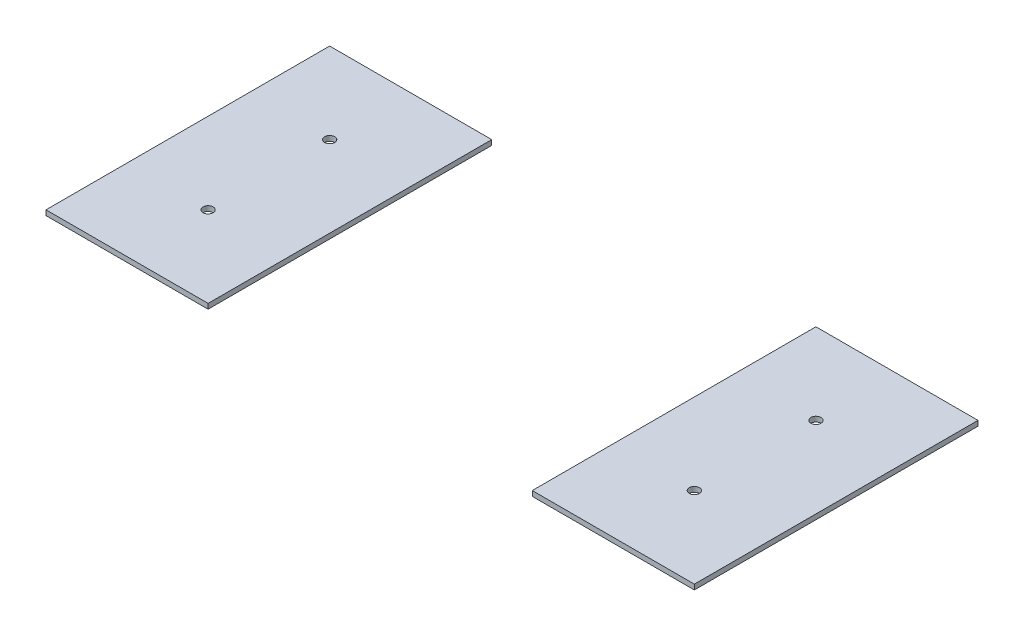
ISO-10303-21;
HEADER;
FILE_DESCRIPTION(('STEP AP214'),'2;1');
FILE_NAME('part.step','',(''),(''),'','','');
FILE_SCHEMA(('AUTOMOTIVE_DESIGN { 1 0 10303 214 1 1 1 1 }'));
ENDSEC;
DATA;
#1=APPLICATION_CONTEXT('core data for automotive mechanical design processes');
#2=APPLICATION_PROTOCOL_DEFINITION('international standard','automotive_design',2000,#1);
#3=PRODUCT_CONTEXT('',#1,'mechanical');
#4=PRODUCT('Part','Part','',(#3));
#5=PRODUCT_RELATED_PRODUCT_CATEGORY('part','',(#4));
#6=PRODUCT_DEFINITION_FORMATION('','',#4);
#7=PRODUCT_DEFINITION_CONTEXT('part definition',#1,'design');
#8=PRODUCT_DEFINITION('design','',#6,#7);
#9=PRODUCT_DEFINITION_SHAPE('','',#8);
#10=(LENGTH_UNIT() NAMED_UNIT(*) SI_UNIT(.MILLI.,.METRE.));
#11=(NAMED_UNIT(*) PLANE_ANGLE_UNIT() SI_UNIT($,.RADIAN.));
#12=(NAMED_UNIT(*) SI_UNIT($,.STERADIAN.) SOLID_ANGLE_UNIT());
#13=UNCERTAINTY_MEASURE_WITH_UNIT(LENGTH_MEASURE(1.E-05),#10,'distance_accuracy_value','');
#14=(GEOMETRIC_REPRESENTATION_CONTEXT(3) GLOBAL_UNCERTAINTY_ASSIGNED_CONTEXT((#13)) GLOBAL_UNIT_ASSIGNED_CONTEXT((#10,
#11,#12)) REPRESENTATION_CONTEXT('',''));
#15=CARTESIAN_POINT('',(0.,0.,0.));
#16=DIRECTION('',(0.,0.,1.));
#17=DIRECTION('',(1.,0.,0.));
#18=AXIS2_PLACEMENT_3D('',#15,#16,#17);
#19=CARTESIAN_POINT('',(-203.2,0.,177.8));
#20=DIRECTION('',(0.,1.,0.));
#21=DIRECTION('',(-1.,0.,0.));
#22=AXIS2_PLACEMENT_3D('',#19,#20,#21);
#23=PLANE('',#22);
#24=CARTESIAN_POINT('',(152.4,0.,-38.1));
#25=DIRECTION('',(0.,1.,0.));
#26=DIRECTION('',(1.,0.,0.));
#27=AXIS2_PLACEMENT_3D('',#24,#25,#26);
#28=CIRCLE('',#27,3.175);
#29=CARTESIAN_POINT('',(155.575,0.,-38.1));
#30=VERTEX_POINT('',#29);
#31=EDGE_CURVE('E113',#30,#30,#28,.T.);
#32=ORIENTED_EDGE('',*,*,#31,.T.);
#33=EDGE_LOOP('',(#32));
#34=FACE_BOUND('',#33,.T.);
#35=CARTESIAN_POINT('',(152.4,0.,38.1));
#36=DIRECTION('',(0.,1.,0.));
#37=DIRECTION('',(1.,0.,0.));
#38=AXIS2_PLACEMENT_3D('',#35,#36,#37);
#39=CIRCLE('',#38,3.17499999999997);
#40=CARTESIAN_POINT('',(155.575,0.,38.1));
#41=VERTEX_POINT('',#40);
#42=EDGE_CURVE('E104',#41,#41,#39,.T.);
#43=ORIENTED_EDGE('',*,*,#42,.T.);
#44=EDGE_LOOP('',(#43));
#45=FACE_BOUND('',#44,.T.);
#46=DIRECTION('',(1.,0.,0.));
#47=VECTOR('',#46,1.);
#48=CARTESIAN_POINT('',(-203.2,0.,88.9));
#49=LINE('',#48,#47);
#50=CARTESIAN_POINT('',(101.6,0.,88.9));
#51=VERTEX_POINT('',#50);
#52=CARTESIAN_POINT('',(203.2,0.,88.9));
#53=VERTEX_POINT('',#52);
#54=EDGE_CURVE('E81',#51,#53,#49,.T.);
#55=ORIENTED_EDGE('',*,*,#54,.F.);
#56=DIRECTION('',(0.,0.,-1.));
#57=VECTOR('',#56,1.);
#58=CARTESIAN_POINT('',(101.6,0.,88.9));
#59=LINE('',#58,#57);
#60=CARTESIAN_POINT('',(101.6,0.,-88.8999999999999));
#61=VERTEX_POINT('',#60);
#62=EDGE_CURVE('E98',#51,#61,#59,.T.);
#63=ORIENTED_EDGE('',*,*,#62,.T.);
#64=DIRECTION('',(-1.,0.,0.));
#65=VECTOR('',#64,1.);
#66=CARTESIAN_POINT('',(-203.2,0.,-88.9));
#67=LINE('',#66,#65);
#68=CARTESIAN_POINT('',(203.2,0.,-88.9));
#69=VERTEX_POINT('',#68);
#70=EDGE_CURVE('E97',#69,#61,#67,.T.);
#71=ORIENTED_EDGE('',*,*,#70,.F.);
#72=DIRECTION('',(0.,0.,-1.));
#73=VECTOR('',#72,1.);
#74=CARTESIAN_POINT('',(203.2,0.,177.8));
#75=LINE('',#74,#73);
#76=EDGE_CURVE('E85',#53,#69,#75,.T.);
#77=ORIENTED_EDGE('',*,*,#76,.F.);
#78=EDGE_LOOP('',(#55,#63,#71,#77));
#79=FACE_BOUND('',#78,.T.);
#80=ADVANCED_FACE('F42',(#34,#45,#79),#23,.F.);
#81=CARTESIAN_POINT('',(203.2,3.17500000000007,177.8));
#82=DIRECTION('',(0.,-1.,0.));
#83=DIRECTION('',(1.,0.,0.));
#84=AXIS2_PLACEMENT_3D('',#81,#82,#83);
#85=PLANE('',#84);
#86=CARTESIAN_POINT('',(152.4,3.17500000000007,-38.1));
#87=DIRECTION('',(0.,1.,0.));
#88=DIRECTION('',(1.,0.,0.));
#89=AXIS2_PLACEMENT_3D('',#86,#87,#88);
#90=CIRCLE('',#89,3.175);
#91=CARTESIAN_POINT('',(155.575,3.17500000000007,-38.1));
#92=VERTEX_POINT('',#91);
#93=EDGE_CURVE('E108',#92,#92,#90,.T.);
#94=ORIENTED_EDGE('',*,*,#93,.F.);
#95=EDGE_LOOP('',(#94));
#96=FACE_BOUND('',#95,.T.);
#97=CARTESIAN_POINT('',(152.4,3.17500000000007,38.1));
#98=DIRECTION('',(0.,1.,0.));
#99=DIRECTION('',(1.,0.,0.));
#100=AXIS2_PLACEMENT_3D('',#97,#98,#99);
#101=CIRCLE('',#100,3.17499999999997);
#102=CARTESIAN_POINT('',(155.575,3.17500000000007,38.1));
#103=VERTEX_POINT('',#102);
#104=EDGE_CURVE('E112',#103,#103,#101,.T.);
#105=ORIENTED_EDGE('',*,*,#104,.F.);
#106=EDGE_LOOP('',(#105));
#107=FACE_BOUND('',#106,.T.);
#108=DIRECTION('',(1.,0.,0.));
#109=VECTOR('',#108,1.);
#110=CARTESIAN_POINT('',(-203.2,3.175,-88.9));
#111=LINE('',#110,#109);
#112=CARTESIAN_POINT('',(101.6,3.17500000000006,-88.8999999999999));
#113=VERTEX_POINT('',#112);
#114=CARTESIAN_POINT('',(203.2,3.17500000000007,-88.9));
#115=VERTEX_POINT('',#114);
#116=EDGE_CURVE('E93',#113,#115,#111,.T.);
#117=ORIENTED_EDGE('',*,*,#116,.F.);
#118=DIRECTION('',(0.,0.,-1.));
#119=VECTOR('',#118,1.);
#120=CARTESIAN_POINT('',(101.6,3.17500000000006,88.9));
#121=LINE('',#120,#119);
#122=CARTESIAN_POINT('',(101.6,3.17500000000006,88.9));
#123=VERTEX_POINT('',#122);
#124=EDGE_CURVE('E51',#123,#113,#121,.T.);
#125=ORIENTED_EDGE('',*,*,#124,.F.);
#126=DIRECTION('',(-1.,0.,0.));
#127=VECTOR('',#126,1.);
#128=CARTESIAN_POINT('',(-203.2,3.175,88.9));
#129=LINE('',#128,#127);
#130=CARTESIAN_POINT('',(203.2,3.17500000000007,88.9));
#131=VERTEX_POINT('',#130);
#132=EDGE_CURVE('E45',#131,#123,#129,.T.);
#133=ORIENTED_EDGE('',*,*,#132,.F.);
#134=DIRECTION('',(0.,0.,-1.));
#135=VECTOR('',#134,1.);
#136=CARTESIAN_POINT('',(203.2,3.17500000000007,177.8));
#137=LINE('',#136,#135);
#138=EDGE_CURVE('E91',#131,#115,#137,.T.);
#139=ORIENTED_EDGE('',*,*,#138,.T.);
#140=EDGE_LOOP('',(#117,#125,#133,#139));
#141=FACE_BOUND('',#140,.T.);
#142=ADVANCED_FACE('F90',(#96,#107,#141),#85,.F.);
#143=CARTESIAN_POINT('',(-203.2,-0.00100000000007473,-88.9));
#144=DIRECTION('',(0.,0.,1.));
#145=DIRECTION('',(1.,0.,0.));
#146=AXIS2_PLACEMENT_3D('',#143,#144,#145);
#147=PLANE('',#146);
#148=ORIENTED_EDGE('',*,*,#70,.T.);
#149=DIRECTION('',(0.,1.,0.));
#150=VECTOR('',#149,1.);
#151=CARTESIAN_POINT('',(101.6,0.,-88.8999999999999));
#152=LINE('',#151,#150);
#153=EDGE_CURVE('E101',#61,#113,#152,.T.);
#154=ORIENTED_EDGE('',*,*,#153,.T.);
#155=ORIENTED_EDGE('',*,*,#116,.T.);
#156=DIRECTION('',(0.,1.,0.));
#157=VECTOR('',#156,1.);
#158=CARTESIAN_POINT('',(203.2,-0.00100000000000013,-88.9));
#159=LINE('',#158,#157);
#160=EDGE_CURVE('E96',#69,#115,#159,.T.);
#161=ORIENTED_EDGE('',*,*,#160,.F.);
#162=EDGE_LOOP('',(#148,#154,#155,#161));
#163=FACE_BOUND('',#162,.T.);
#164=ADVANCED_FACE('F124',(#163),#147,.F.);
#165=CARTESIAN_POINT('',(-203.2,-0.00100000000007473,88.9));
#166=DIRECTION('',(0.,0.,-1.));
#167=DIRECTION('',(-1.,0.,0.));
#168=AXIS2_PLACEMENT_3D('',#165,#166,#167);
#169=PLANE('',#168);
#170=ORIENTED_EDGE('',*,*,#132,.T.);
#171=DIRECTION('',(0.,1.,0.));
#172=VECTOR('',#171,1.);
#173=CARTESIAN_POINT('',(101.6,0.,88.9));
#174=LINE('',#173,#172);
#175=EDGE_CURVE('E12',#51,#123,#174,.T.);
#176=ORIENTED_EDGE('',*,*,#175,.F.);
#177=ORIENTED_EDGE('',*,*,#54,.T.);
#178=DIRECTION('',(0.,1.,0.));
#179=VECTOR('',#178,1.);
#180=CARTESIAN_POINT('',(203.2,-0.00100000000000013,88.9));
#181=LINE('',#180,#179);
#182=EDGE_CURVE('E77',#53,#131,#181,.T.);
#183=ORIENTED_EDGE('',*,*,#182,.T.);
#184=EDGE_LOOP('',(#170,#176,#177,#183));
#185=FACE_BOUND('',#184,.T.);
#186=ADVANCED_FACE('F79',(#185),#169,.F.);
#187=CARTESIAN_POINT('',(203.2,0.,177.8));
#188=DIRECTION('',(-1.,0.,0.));
#189=DIRECTION('',(0.,0.,1.));
#190=AXIS2_PLACEMENT_3D('',#187,#188,#189);
#191=PLANE('',#190);
#192=ORIENTED_EDGE('',*,*,#138,.F.);
#193=ORIENTED_EDGE('',*,*,#182,.F.);
#194=ORIENTED_EDGE('',*,*,#76,.T.);
#195=ORIENTED_EDGE('',*,*,#160,.T.);
#196=EDGE_LOOP('',(#192,#193,#194,#195));
#197=FACE_BOUND('',#196,.T.);
#198=ADVANCED_FACE('F94',(#197),#191,.F.);
#199=CARTESIAN_POINT('',(152.4,0.,-38.1));
#200=DIRECTION('',(0.,1.,0.));
#201=DIRECTION('',(-1.,0.,0.));
#202=AXIS2_PLACEMENT_3D('',#199,#200,#201);
#203=CYLINDRICAL_SURFACE('',#202,3.175);
#204=ORIENTED_EDGE('',*,*,#31,.F.);
#205=EDGE_LOOP('',(#204));
#206=FACE_BOUND('',#205,.T.);
#207=ORIENTED_EDGE('',*,*,#93,.T.);
#208=EDGE_LOOP('',(#207));
#209=FACE_BOUND('',#208,.T.);
#210=ADVANCED_FACE('F142',(#206,#209),#203,.F.);
#211=CARTESIAN_POINT('',(152.4,0.,38.1));
#212=DIRECTION('',(0.,1.,0.));
#213=DIRECTION('',(-1.,0.,0.));
#214=AXIS2_PLACEMENT_3D('',#211,#212,#213);
#215=CYLINDRICAL_SURFACE('',#214,3.17499999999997);
#216=ORIENTED_EDGE('',*,*,#42,.F.);
#217=EDGE_LOOP('',(#216));
#218=FACE_BOUND('',#217,.T.);
#219=ORIENTED_EDGE('',*,*,#104,.T.);
#220=EDGE_LOOP('',(#219));
#221=FACE_BOUND('',#220,.T.);
#222=ADVANCED_FACE('F139',(#218,#221),#215,.F.);
#223=CARTESIAN_POINT('',(101.6,0.,88.9));
#224=DIRECTION('',(1.,0.,0.));
#225=DIRECTION('',(0.,1.,0.));
#226=AXIS2_PLACEMENT_3D('',#223,#224,#225);
#227=PLANE('',#226);
#228=ORIENTED_EDGE('',*,*,#124,.T.);
#229=ORIENTED_EDGE('',*,*,#153,.F.);
#230=ORIENTED_EDGE('',*,*,#62,.F.);
#231=ORIENTED_EDGE('',*,*,#175,.T.);
#232=EDGE_LOOP('',(#228,#229,#230,#231));
#233=FACE_BOUND('',#232,.T.);
#234=ADVANCED_FACE('F127',(#233),#227,.F.);
#235=CLOSED_SHELL('',(#80,#142,#164,#186,#198,#210,#222,#234));
#236=MANIFOLD_SOLID_BREP('B2',#235);
#237=CARTESIAN_POINT('',(-152.4,0.,-38.1));
#238=DIRECTION('',(0.,1.,0.));
#239=DIRECTION('',(-1.,0.,0.));
#240=AXIS2_PLACEMENT_3D('',#237,#238,#239);
#241=CYLINDRICAL_SURFACE('',#240,3.175);
#242=CARTESIAN_POINT('',(-152.4,0.,-38.1));
#243=DIRECTION('',(0.,1.,0.));
#244=DIRECTION('',(-1.,0.,0.));
#245=AXIS2_PLACEMENT_3D('',#242,#243,#244);
#246=CIRCLE('',#245,3.175);
#247=CARTESIAN_POINT('',(-155.575,0.,-38.1));
#248=VERTEX_POINT('',#247);
#249=EDGE_CURVE('E288',#248,#248,#246,.T.);
#250=ORIENTED_EDGE('',*,*,#249,.F.);
#251=EDGE_LOOP('',(#250));
#252=FACE_BOUND('',#251,.T.);
#253=CARTESIAN_POINT('',(-152.4,3.17500000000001,-38.1));
#254=DIRECTION('',(0.,1.,0.));
#255=DIRECTION('',(-1.,0.,0.));
#256=AXIS2_PLACEMENT_3D('',#253,#254,#255);
#257=CIRCLE('',#256,3.175);
#258=CARTESIAN_POINT('',(-155.575,3.17500000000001,-38.1));
#259=VERTEX_POINT('',#258);
#260=EDGE_CURVE('E285',#259,#259,#257,.T.);
#261=ORIENTED_EDGE('',*,*,#260,.T.);
#262=EDGE_LOOP('',(#261));
#263=FACE_BOUND('',#262,.T.);
#264=ADVANCED_FACE('F207',(#252,#263),#241,.F.);
#265=CARTESIAN_POINT('',(-152.4,0.,38.1));
#266=DIRECTION('',(0.,1.,0.));
#267=DIRECTION('',(-1.,0.,0.));
#268=AXIS2_PLACEMENT_3D('',#265,#266,#267);
#269=CYLINDRICAL_SURFACE('',#268,3.17499999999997);
#270=CARTESIAN_POINT('',(-152.4,0.,38.1));
#271=DIRECTION('',(0.,1.,0.));
#272=DIRECTION('',(-1.,0.,0.));
#273=AXIS2_PLACEMENT_3D('',#270,#271,#272);
#274=CIRCLE('',#273,3.17499999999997);
#275=CARTESIAN_POINT('',(-155.575,0.,38.1));
#276=VERTEX_POINT('',#275);
#277=EDGE_CURVE('E282',#276,#276,#274,.T.);
#278=ORIENTED_EDGE('',*,*,#277,.F.);
#279=EDGE_LOOP('',(#278));
#280=FACE_BOUND('',#279,.T.);
#281=CARTESIAN_POINT('',(-152.4,3.17500000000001,38.1));
#282=DIRECTION('',(0.,1.,0.));
#283=DIRECTION('',(-1.,0.,0.));
#284=AXIS2_PLACEMENT_3D('',#281,#282,#283);
#285=CIRCLE('',#284,3.17499999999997);
#286=CARTESIAN_POINT('',(-155.575,3.17500000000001,38.1));
#287=VERTEX_POINT('',#286);
#288=EDGE_CURVE('E280',#287,#287,#285,.T.);
#289=ORIENTED_EDGE('',*,*,#288,.T.);
#290=EDGE_LOOP('',(#289));
#291=FACE_BOUND('',#290,.T.);
#292=ADVANCED_FACE('F306',(#280,#291),#269,.F.);
#293=CARTESIAN_POINT('',(-203.2,3.175,177.8));
#294=DIRECTION('',(1.,0.,0.));
#295=DIRECTION('',(0.,0.,-1.));
#296=AXIS2_PLACEMENT_3D('',#293,#294,#295);
#297=PLANE('',#296);
#298=DIRECTION('',(0.,0.,-1.));
#299=VECTOR('',#298,1.);
#300=CARTESIAN_POINT('',(-203.2,0.,177.8));
#301=LINE('',#300,#299);
#302=CARTESIAN_POINT('',(-203.2,0.,88.9));
#303=VERTEX_POINT('',#302);
#304=CARTESIAN_POINT('',(-203.2,0.,-88.9));
#305=VERTEX_POINT('',#304);
#306=EDGE_CURVE('E40',#303,#305,#301,.T.);
#307=ORIENTED_EDGE('',*,*,#306,.F.);
#308=DIRECTION('',(0.,1.,0.));
#309=VECTOR('',#308,1.);
#310=CARTESIAN_POINT('',(-203.2,-0.00100000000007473,88.9));
#311=LINE('',#310,#309);
#312=CARTESIAN_POINT('',(-203.2,3.175,88.9));
#313=VERTEX_POINT('',#312);
#314=EDGE_CURVE('E270',#303,#313,#311,.T.);
#315=ORIENTED_EDGE('',*,*,#314,.T.);
#316=DIRECTION('',(0.,0.,-1.));
#317=VECTOR('',#316,1.);
#318=CARTESIAN_POINT('',(-203.2,3.175,177.8));
#319=LINE('',#318,#317);
#320=CARTESIAN_POINT('',(-203.2,3.175,-88.8999999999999));
#321=VERTEX_POINT('',#320);
#322=EDGE_CURVE('E215',#313,#321,#319,.T.);
#323=ORIENTED_EDGE('',*,*,#322,.T.);
#324=DIRECTION('',(0.,1.,0.));
#325=VECTOR('',#324,1.);
#326=CARTESIAN_POINT('',(-203.2,-0.00100000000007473,-88.9));
#327=LINE('',#326,#325);
#328=EDGE_CURVE('E268',#305,#321,#327,.T.);
#329=ORIENTED_EDGE('',*,*,#328,.F.);
#330=EDGE_LOOP('',(#307,#315,#323,#329));
#331=FACE_BOUND('',#330,.T.);
#332=ADVANCED_FACE('F209',(#331),#297,.F.);
#333=CARTESIAN_POINT('',(-203.2,-0.00100000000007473,-88.9));
#334=DIRECTION('',(0.,0.,1.));
#335=DIRECTION('',(1.,0.,0.));
#336=AXIS2_PLACEMENT_3D('',#333,#334,#335);
#337=PLANE('',#336);
#338=DIRECTION('',(1.,0.,0.));
#339=VECTOR('',#338,1.);
#340=CARTESIAN_POINT('',(-203.2,3.175,-88.9));
#341=LINE('',#340,#339);
#342=CARTESIAN_POINT('',(-101.6,3.17500000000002,-88.8999999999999));
#343=VERTEX_POINT('',#342);
#344=EDGE_CURVE('E262',#321,#343,#341,.T.);
#345=ORIENTED_EDGE('',*,*,#344,.T.);
#346=DIRECTION('',(0.,1.,0.));
#347=VECTOR('',#346,1.);
#348=CARTESIAN_POINT('',(-101.6,-1.21864324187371E-13,-88.8999999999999));
#349=LINE('',#348,#347);
#350=CARTESIAN_POINT('',(-101.6,-1.21864324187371E-13,-88.8999999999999));
#351=VERTEX_POINT('',#350);
#352=EDGE_CURVE('E250',#351,#343,#349,.T.);
#353=ORIENTED_EDGE('',*,*,#352,.F.);
#354=DIRECTION('',(-1.,0.,0.));
#355=VECTOR('',#354,1.);
#356=CARTESIAN_POINT('',(-203.2,0.,-88.9));
#357=LINE('',#356,#355);
#358=EDGE_CURVE('E260',#351,#305,#357,.T.);
#359=ORIENTED_EDGE('',*,*,#358,.T.);
#360=ORIENTED_EDGE('',*,*,#328,.T.);
#361=EDGE_LOOP('',(#345,#353,#359,#360));
#362=FACE_BOUND('',#361,.T.);
#363=ADVANCED_FACE('F259',(#362),#337,.F.);
#364=CARTESIAN_POINT('',(-203.2,-0.00100000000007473,88.9));
#365=DIRECTION('',(0.,0.,-1.));
#366=DIRECTION('',(-1.,0.,0.));
#367=AXIS2_PLACEMENT_3D('',#364,#365,#366);
#368=PLANE('',#367);
#369=DIRECTION('',(1.,0.,0.));
#370=VECTOR('',#369,1.);
#371=CARTESIAN_POINT('',(-203.2,0.,88.9));
#372=LINE('',#371,#370);
#373=CARTESIAN_POINT('',(-101.6,-1.21864324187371E-13,88.9));
#374=VERTEX_POINT('',#373);
#375=EDGE_CURVE('E266',#303,#374,#372,.T.);
#376=ORIENTED_EDGE('',*,*,#375,.T.);
#377=DIRECTION('',(0.,1.,0.));
#378=VECTOR('',#377,1.);
#379=CARTESIAN_POINT('',(-101.6,-1.21864324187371E-13,88.9));
#380=LINE('',#379,#378);
#381=CARTESIAN_POINT('',(-101.6,3.17500000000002,88.9));
#382=VERTEX_POINT('',#381);
#383=EDGE_CURVE('E251',#374,#382,#380,.T.);
#384=ORIENTED_EDGE('',*,*,#383,.T.);
#385=DIRECTION('',(-1.,0.,0.));
#386=VECTOR('',#385,1.);
#387=CARTESIAN_POINT('',(-203.2,3.175,88.9));
#388=LINE('',#387,#386);
#389=EDGE_CURVE('E277',#382,#313,#388,.T.);
#390=ORIENTED_EDGE('',*,*,#389,.T.);
#391=ORIENTED_EDGE('',*,*,#314,.F.);
#392=EDGE_LOOP('',(#376,#384,#390,#391));
#393=FACE_BOUND('',#392,.T.);
#394=ADVANCED_FACE('F294',(#393),#368,.F.);
#395=CARTESIAN_POINT('',(203.2,3.17500000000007,177.8));
#396=DIRECTION('',(0.,-1.,0.));
#397=DIRECTION('',(1.,0.,0.));
#398=AXIS2_PLACEMENT_3D('',#395,#396,#397);
#399=PLANE('',#398);
#400=ORIENTED_EDGE('',*,*,#288,.F.);
#401=EDGE_LOOP('',(#400));
#402=FACE_BOUND('',#401,.T.);
#403=ORIENTED_EDGE('',*,*,#260,.F.);
#404=EDGE_LOOP('',(#403));
#405=FACE_BOUND('',#404,.T.);
#406=ORIENTED_EDGE('',*,*,#389,.F.);
#407=DIRECTION('',(0.,0.,1.));
#408=VECTOR('',#407,1.);
#409=CARTESIAN_POINT('',(-101.6,3.17500000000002,-88.8999999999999));
#410=LINE('',#409,#408);
#411=EDGE_CURVE('E222',#343,#382,#410,.T.);
#412=ORIENTED_EDGE('',*,*,#411,.F.);
#413=ORIENTED_EDGE('',*,*,#344,.F.);
#414=ORIENTED_EDGE('',*,*,#322,.F.);
#415=EDGE_LOOP('',(#406,#412,#413,#414));
#416=FACE_BOUND('',#415,.T.);
#417=ADVANCED_FACE('F276',(#402,#405,#416),#399,.F.);
#418=CARTESIAN_POINT('',(-203.2,0.,177.8));
#419=DIRECTION('',(0.,1.,0.));
#420=DIRECTION('',(-1.,0.,0.));
#421=AXIS2_PLACEMENT_3D('',#418,#419,#420);
#422=PLANE('',#421);
#423=ORIENTED_EDGE('',*,*,#277,.T.);
#424=EDGE_LOOP('',(#423));
#425=FACE_BOUND('',#424,.T.);
#426=ORIENTED_EDGE('',*,*,#249,.T.);
#427=EDGE_LOOP('',(#426));
#428=FACE_BOUND('',#427,.T.);
#429=ORIENTED_EDGE('',*,*,#358,.F.);
#430=DIRECTION('',(0.,0.,1.));
#431=VECTOR('',#430,1.);
#432=CARTESIAN_POINT('',(-101.6,-1.21864324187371E-13,-88.8999999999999));
#433=LINE('',#432,#431);
#434=EDGE_CURVE('E247',#351,#374,#433,.T.);
#435=ORIENTED_EDGE('',*,*,#434,.T.);
#436=ORIENTED_EDGE('',*,*,#375,.F.);
#437=ORIENTED_EDGE('',*,*,#306,.T.);
#438=EDGE_LOOP('',(#429,#435,#436,#437));
#439=FACE_BOUND('',#438,.T.);
#440=ADVANCED_FACE('F264',(#425,#428,#439),#422,.F.);
#441=CARTESIAN_POINT('',(-101.6,-1.21864324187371E-13,-88.8999999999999));
#442=DIRECTION('',(-1.,0.,0.));
#443=DIRECTION('',(0.,-1.,0.));
#444=AXIS2_PLACEMENT_3D('',#441,#442,#443);
#445=PLANE('',#444);
#446=ORIENTED_EDGE('',*,*,#411,.T.);
#447=ORIENTED_EDGE('',*,*,#383,.F.);
#448=ORIENTED_EDGE('',*,*,#434,.F.);
#449=ORIENTED_EDGE('',*,*,#352,.T.);
#450=EDGE_LOOP('',(#446,#447,#448,#449));
#451=FACE_BOUND('',#450,.T.);
#452=ADVANCED_FACE('F249',(#451),#445,.F.);
#453=CLOSED_SHELL('',(#264,#292,#332,#363,#394,#417,#440,#452));
#454=MANIFOLD_SOLID_BREP('B6',#453);
#455=ADVANCED_BREP_SHAPE_REPRESENTATION('',(#18,#236,#454),#14);
#456=SHAPE_DEFINITION_REPRESENTATION(#9,#455);
ENDSEC;
END-ISO-10303-21;
